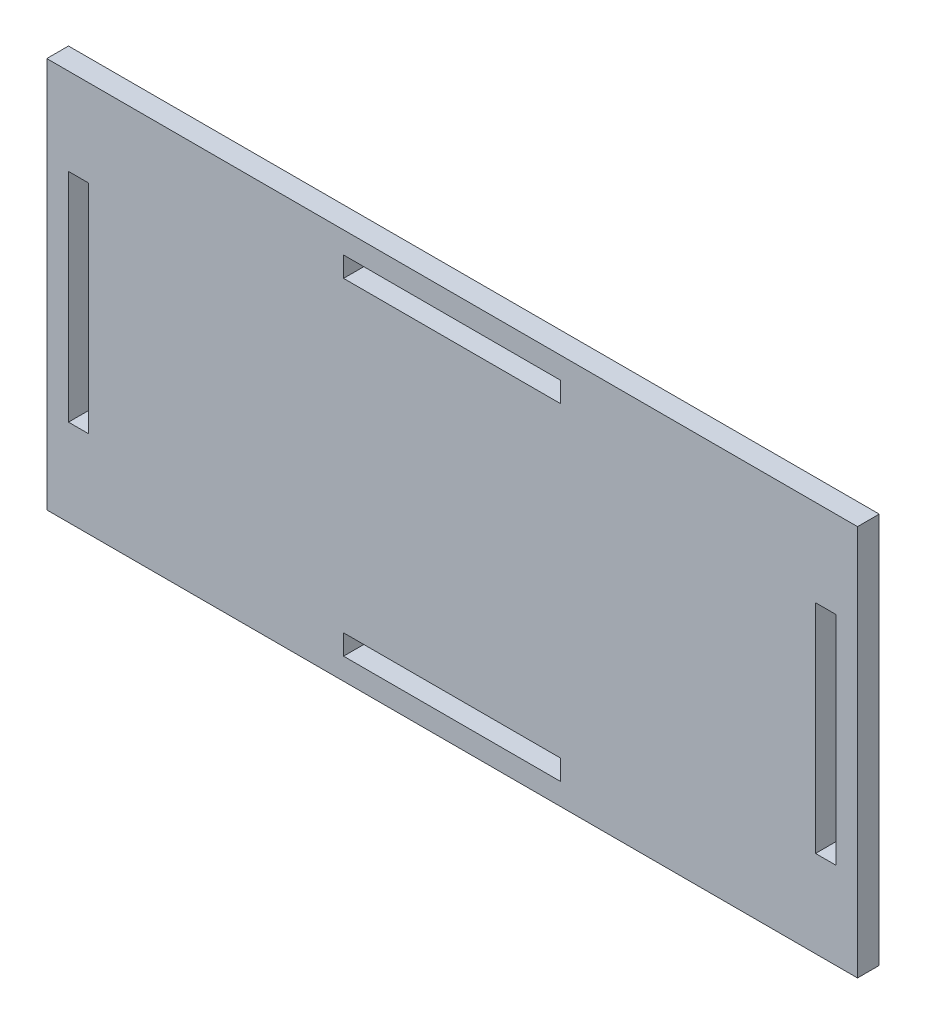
ISO-10303-21;
HEADER;
FILE_DESCRIPTION(('STEP AP214'),'2;1');
FILE_NAME('part.step','',(''),(''),'','','');
FILE_SCHEMA(('AUTOMOTIVE_DESIGN { 1 0 10303 214 1 1 1 1 }'));
ENDSEC;
DATA;
#1=APPLICATION_CONTEXT('core data for automotive mechanical design processes');
#2=APPLICATION_PROTOCOL_DEFINITION('international standard','automotive_design',2000,#1);
#3=PRODUCT_CONTEXT('',#1,'mechanical');
#4=PRODUCT('Part','Part','',(#3));
#5=PRODUCT_RELATED_PRODUCT_CATEGORY('part','',(#4));
#6=PRODUCT_DEFINITION_FORMATION('','',#4);
#7=PRODUCT_DEFINITION_CONTEXT('part definition',#1,'design');
#8=PRODUCT_DEFINITION('design','',#6,#7);
#9=PRODUCT_DEFINITION_SHAPE('','',#8);
#10=(LENGTH_UNIT() NAMED_UNIT(*) SI_UNIT(.MILLI.,.METRE.));
#11=(NAMED_UNIT(*) PLANE_ANGLE_UNIT() SI_UNIT($,.RADIAN.));
#12=(NAMED_UNIT(*) SI_UNIT($,.STERADIAN.) SOLID_ANGLE_UNIT());
#13=UNCERTAINTY_MEASURE_WITH_UNIT(LENGTH_MEASURE(1.E-05),#10,'distance_accuracy_value','');
#14=(GEOMETRIC_REPRESENTATION_CONTEXT(3) GLOBAL_UNCERTAINTY_ASSIGNED_CONTEXT((#13)) GLOBAL_UNIT_ASSIGNED_CONTEXT((#10,
#11,#12)) REPRESENTATION_CONTEXT('',''));
#15=CARTESIAN_POINT('',(0.,0.,0.));
#16=DIRECTION('',(0.,0.,1.));
#17=DIRECTION('',(1.,0.,0.));
#18=AXIS2_PLACEMENT_3D('',#15,#16,#17);
#19=CARTESIAN_POINT('',(0.,0.,3.));
#20=DIRECTION('',(0.,0.,-1.));
#21=DIRECTION('',(-1.,0.,0.));
#22=AXIS2_PLACEMENT_3D('',#19,#20,#21);
#23=PLANE('',#22);
#24=DIRECTION('',(0.,-1.,0.));
#25=VECTOR('',#24,1.);
#26=CARTESIAN_POINT('',(-15.,-21.2,3.));
#27=LINE('',#26,#25);
#28=CARTESIAN_POINT('',(-15.,-21.2,3.));
#29=VERTEX_POINT('',#28);
#30=CARTESIAN_POINT('',(-15.,-24.,3.));
#31=VERTEX_POINT('',#30);
#32=EDGE_CURVE('E206',#29,#31,#27,.T.);
#33=ORIENTED_EDGE('',*,*,#32,.F.);
#34=DIRECTION('',(-1.,0.,0.));
#35=VECTOR('',#34,1.);
#36=CARTESIAN_POINT('',(-15.,-21.2,3.));
#37=LINE('',#36,#35);
#38=CARTESIAN_POINT('',(15.,-21.2,3.));
#39=VERTEX_POINT('',#38);
#40=EDGE_CURVE('E214',#39,#29,#37,.T.);
#41=ORIENTED_EDGE('',*,*,#40,.F.);
#42=DIRECTION('',(0.,1.,0.));
#43=VECTOR('',#42,1.);
#44=CARTESIAN_POINT('',(15.,-21.2,3.));
#45=LINE('',#44,#43);
#46=CARTESIAN_POINT('',(15.,-24.,3.));
#47=VERTEX_POINT('',#46);
#48=EDGE_CURVE('E211',#47,#39,#45,.T.);
#49=ORIENTED_EDGE('',*,*,#48,.F.);
#50=DIRECTION('',(1.,0.,0.));
#51=VECTOR('',#50,1.);
#52=CARTESIAN_POINT('',(-15.,-24.,3.));
#53=LINE('',#52,#51);
#54=EDGE_CURVE('E208',#31,#47,#53,.T.);
#55=ORIENTED_EDGE('',*,*,#54,.F.);
#56=EDGE_LOOP('',(#33,#41,#49,#55));
#57=FACE_BOUND('',#56,.T.);
#58=DIRECTION('',(0.,1.,0.));
#59=VECTOR('',#58,1.);
#60=CARTESIAN_POINT('',(15.,21.2,3.));
#61=LINE('',#60,#59);
#62=CARTESIAN_POINT('',(15.,21.2,3.));
#63=VERTEX_POINT('',#62);
#64=CARTESIAN_POINT('',(15.,24.,3.));
#65=VERTEX_POINT('',#64);
#66=EDGE_CURVE('E268',#63,#65,#61,.T.);
#67=ORIENTED_EDGE('',*,*,#66,.F.);
#68=DIRECTION('',(1.,0.,0.));
#69=VECTOR('',#68,1.);
#70=CARTESIAN_POINT('',(-15.,21.2,3.));
#71=LINE('',#70,#69);
#72=CARTESIAN_POINT('',(-15.,21.2,3.));
#73=VERTEX_POINT('',#72);
#74=EDGE_CURVE('E276',#73,#63,#71,.T.);
#75=ORIENTED_EDGE('',*,*,#74,.F.);
#76=DIRECTION('',(0.,-1.,0.));
#77=VECTOR('',#76,1.);
#78=CARTESIAN_POINT('',(-15.,21.2,3.));
#79=LINE('',#78,#77);
#80=CARTESIAN_POINT('',(-15.,24.,3.));
#81=VERTEX_POINT('',#80);
#82=EDGE_CURVE('E273',#81,#73,#79,.T.);
#83=ORIENTED_EDGE('',*,*,#82,.F.);
#84=DIRECTION('',(-1.,0.,0.));
#85=VECTOR('',#84,1.);
#86=CARTESIAN_POINT('',(-15.,24.,3.));
#87=LINE('',#86,#85);
#88=EDGE_CURVE('E270',#65,#81,#87,.T.);
#89=ORIENTED_EDGE('',*,*,#88,.F.);
#90=EDGE_LOOP('',(#67,#75,#83,#89));
#91=FACE_BOUND('',#90,.T.);
#92=DIRECTION('',(0.,1.,0.));
#93=VECTOR('',#92,1.);
#94=CARTESIAN_POINT('',(56.,-27.,3.));
#95=LINE('',#94,#93);
#96=CARTESIAN_POINT('',(56.,-27.,3.));
#97=VERTEX_POINT('',#96);
#98=CARTESIAN_POINT('',(56.,27.,3.));
#99=VERTEX_POINT('',#98);
#100=EDGE_CURVE('E299',#97,#99,#95,.T.);
#101=ORIENTED_EDGE('',*,*,#100,.T.);
#102=DIRECTION('',(-1.,0.,0.));
#103=VECTOR('',#102,1.);
#104=CARTESIAN_POINT('',(-56.,27.,3.));
#105=LINE('',#104,#103);
#106=CARTESIAN_POINT('',(-56.,27.,3.));
#107=VERTEX_POINT('',#106);
#108=EDGE_CURVE('E302',#99,#107,#105,.T.);
#109=ORIENTED_EDGE('',*,*,#108,.T.);
#110=DIRECTION('',(0.,-1.,0.));
#111=VECTOR('',#110,1.);
#112=CARTESIAN_POINT('',(-56.,-27.,3.));
#113=LINE('',#112,#111);
#114=CARTESIAN_POINT('',(-56.,-27.,3.));
#115=VERTEX_POINT('',#114);
#116=EDGE_CURVE('E305',#107,#115,#113,.T.);
#117=ORIENTED_EDGE('',*,*,#116,.T.);
#118=DIRECTION('',(1.,0.,0.));
#119=VECTOR('',#118,1.);
#120=CARTESIAN_POINT('',(-56.,-27.,3.));
#121=LINE('',#120,#119);
#122=EDGE_CURVE('E307',#115,#97,#121,.T.);
#123=ORIENTED_EDGE('',*,*,#122,.T.);
#124=EDGE_LOOP('',(#101,#109,#117,#123));
#125=FACE_BOUND('',#124,.T.);
#126=DIRECTION('',(0.,1.,0.));
#127=VECTOR('',#126,1.);
#128=CARTESIAN_POINT('',(-50.2,-15.,3.));
#129=LINE('',#128,#127);
#130=CARTESIAN_POINT('',(-50.2,-15.,3.));
#131=VERTEX_POINT('',#130);
#132=CARTESIAN_POINT('',(-50.2,15.,3.));
#133=VERTEX_POINT('',#132);
#134=EDGE_CURVE('E237',#131,#133,#129,.T.);
#135=ORIENTED_EDGE('',*,*,#134,.F.);
#136=DIRECTION('',(1.,0.,0.));
#137=VECTOR('',#136,1.);
#138=CARTESIAN_POINT('',(-53.,-15.,3.));
#139=LINE('',#138,#137);
#140=CARTESIAN_POINT('',(-53.,-15.,3.));
#141=VERTEX_POINT('',#140);
#142=EDGE_CURVE('E245',#141,#131,#139,.T.);
#143=ORIENTED_EDGE('',*,*,#142,.F.);
#144=DIRECTION('',(0.,-1.,0.));
#145=VECTOR('',#144,1.);
#146=CARTESIAN_POINT('',(-53.,-15.,3.));
#147=LINE('',#146,#145);
#148=CARTESIAN_POINT('',(-53.,15.,3.));
#149=VERTEX_POINT('',#148);
#150=EDGE_CURVE('E242',#149,#141,#147,.T.);
#151=ORIENTED_EDGE('',*,*,#150,.F.);
#152=DIRECTION('',(-1.,0.,0.));
#153=VECTOR('',#152,1.);
#154=CARTESIAN_POINT('',(-53.,15.,3.));
#155=LINE('',#154,#153);
#156=EDGE_CURVE('E239',#133,#149,#155,.T.);
#157=ORIENTED_EDGE('',*,*,#156,.F.);
#158=EDGE_LOOP('',(#135,#143,#151,#157));
#159=FACE_BOUND('',#158,.T.);
#160=DIRECTION('',(0.,1.,0.));
#161=VECTOR('',#160,1.);
#162=CARTESIAN_POINT('',(53.0000000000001,-14.9999999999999,3.));
#163=LINE('',#162,#161);
#164=CARTESIAN_POINT('',(53.0000000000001,-14.9999999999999,3.));
#165=VERTEX_POINT('',#164);
#166=CARTESIAN_POINT('',(53.,15.0000000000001,3.));
#167=VERTEX_POINT('',#166);
#168=EDGE_CURVE('E170',#165,#167,#163,.T.);
#169=ORIENTED_EDGE('',*,*,#168,.F.);
#170=DIRECTION('',(1.,0.,0.));
#171=VECTOR('',#170,1.);
#172=CARTESIAN_POINT('',(53.0000000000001,-14.9999999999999,3.));
#173=LINE('',#172,#171);
#174=CARTESIAN_POINT('',(50.2000000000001,-14.9999999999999,3.));
#175=VERTEX_POINT('',#174);
#176=EDGE_CURVE('E192',#175,#165,#173,.T.);
#177=ORIENTED_EDGE('',*,*,#176,.F.);
#178=DIRECTION('',(0.,-1.,0.));
#179=VECTOR('',#178,1.);
#180=CARTESIAN_POINT('',(50.2000000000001,-14.9999999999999,3.));
#181=LINE('',#180,#179);
#182=CARTESIAN_POINT('',(50.2,15.0000000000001,3.));
#183=VERTEX_POINT('',#182);
#184=EDGE_CURVE('E190',#183,#175,#181,.T.);
#185=ORIENTED_EDGE('',*,*,#184,.F.);
#186=DIRECTION('',(-1.,0.,0.));
#187=VECTOR('',#186,1.);
#188=CARTESIAN_POINT('',(53.,15.0000000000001,3.));
#189=LINE('',#188,#187);
#190=EDGE_CURVE('E178',#167,#183,#189,.T.);
#191=ORIENTED_EDGE('',*,*,#190,.F.);
#192=EDGE_LOOP('',(#169,#177,#185,#191));
#193=FACE_BOUND('',#192,.T.);
#194=ADVANCED_FACE('F33',(#57,#91,#125,#159,#193),#23,.F.);
#195=CARTESIAN_POINT('',(0.,0.,0.));
#196=DIRECTION('',(0.,0.,-1.));
#197=DIRECTION('',(-1.,0.,0.));
#198=AXIS2_PLACEMENT_3D('',#195,#196,#197);
#199=PLANE('',#198);
#200=DIRECTION('',(0.,1.,0.));
#201=VECTOR('',#200,1.);
#202=CARTESIAN_POINT('',(56.,-27.,0.));
#203=LINE('',#202,#201);
#204=CARTESIAN_POINT('',(56.,-27.,0.));
#205=VERTEX_POINT('',#204);
#206=CARTESIAN_POINT('',(56.,27.,0.));
#207=VERTEX_POINT('',#206);
#208=EDGE_CURVE('E298',#205,#207,#203,.T.);
#209=ORIENTED_EDGE('',*,*,#208,.F.);
#210=DIRECTION('',(1.,0.,0.));
#211=VECTOR('',#210,1.);
#212=CARTESIAN_POINT('',(-56.,-27.,0.));
#213=LINE('',#212,#211);
#214=CARTESIAN_POINT('',(-56.,-27.,0.));
#215=VERTEX_POINT('',#214);
#216=EDGE_CURVE('E303',#215,#205,#213,.T.);
#217=ORIENTED_EDGE('',*,*,#216,.F.);
#218=DIRECTION('',(0.,-1.,0.));
#219=VECTOR('',#218,1.);
#220=CARTESIAN_POINT('',(-56.,-27.,0.));
#221=LINE('',#220,#219);
#222=CARTESIAN_POINT('',(-56.,27.,0.));
#223=VERTEX_POINT('',#222);
#224=EDGE_CURVE('E314',#223,#215,#221,.T.);
#225=ORIENTED_EDGE('',*,*,#224,.F.);
#226=DIRECTION('',(-1.,0.,0.));
#227=VECTOR('',#226,1.);
#228=CARTESIAN_POINT('',(-56.,27.,0.));
#229=LINE('',#228,#227);
#230=EDGE_CURVE('E312',#207,#223,#229,.T.);
#231=ORIENTED_EDGE('',*,*,#230,.F.);
#232=EDGE_LOOP('',(#209,#217,#225,#231));
#233=FACE_BOUND('',#232,.T.);
#234=DIRECTION('',(1.,0.,0.));
#235=VECTOR('',#234,1.);
#236=CARTESIAN_POINT('',(-15.,21.2,0.));
#237=LINE('',#236,#235);
#238=CARTESIAN_POINT('',(-15.,21.2,0.));
#239=VERTEX_POINT('',#238);
#240=CARTESIAN_POINT('',(15.,21.2,0.));
#241=VERTEX_POINT('',#240);
#242=EDGE_CURVE('E271',#239,#241,#237,.T.);
#243=ORIENTED_EDGE('',*,*,#242,.T.);
#244=DIRECTION('',(0.,1.,0.));
#245=VECTOR('',#244,1.);
#246=CARTESIAN_POINT('',(15.,21.2,0.));
#247=LINE('',#246,#245);
#248=CARTESIAN_POINT('',(15.,24.,0.));
#249=VERTEX_POINT('',#248);
#250=EDGE_CURVE('E267',#241,#249,#247,.T.);
#251=ORIENTED_EDGE('',*,*,#250,.T.);
#252=DIRECTION('',(-1.,0.,0.));
#253=VECTOR('',#252,1.);
#254=CARTESIAN_POINT('',(-15.,24.,0.));
#255=LINE('',#254,#253);
#256=CARTESIAN_POINT('',(-15.,24.,0.));
#257=VERTEX_POINT('',#256);
#258=EDGE_CURVE('E281',#249,#257,#255,.T.);
#259=ORIENTED_EDGE('',*,*,#258,.T.);
#260=DIRECTION('',(0.,-1.,0.));
#261=VECTOR('',#260,1.);
#262=CARTESIAN_POINT('',(-15.,21.2,0.));
#263=LINE('',#262,#261);
#264=EDGE_CURVE('E284',#257,#239,#263,.T.);
#265=ORIENTED_EDGE('',*,*,#264,.T.);
#266=EDGE_LOOP('',(#243,#251,#259,#265));
#267=FACE_BOUND('',#266,.T.);
#268=DIRECTION('',(1.,0.,0.));
#269=VECTOR('',#268,1.);
#270=CARTESIAN_POINT('',(-53.,-15.,0.));
#271=LINE('',#270,#269);
#272=CARTESIAN_POINT('',(-53.,-15.,0.));
#273=VERTEX_POINT('',#272);
#274=CARTESIAN_POINT('',(-50.2,-15.,0.));
#275=VERTEX_POINT('',#274);
#276=EDGE_CURVE('E240',#273,#275,#271,.T.);
#277=ORIENTED_EDGE('',*,*,#276,.T.);
#278=DIRECTION('',(0.,1.,0.));
#279=VECTOR('',#278,1.);
#280=CARTESIAN_POINT('',(-50.2,-15.,0.));
#281=LINE('',#280,#279);
#282=CARTESIAN_POINT('',(-50.2,15.,0.));
#283=VERTEX_POINT('',#282);
#284=EDGE_CURVE('E236',#275,#283,#281,.T.);
#285=ORIENTED_EDGE('',*,*,#284,.T.);
#286=DIRECTION('',(-1.,0.,0.));
#287=VECTOR('',#286,1.);
#288=CARTESIAN_POINT('',(-53.,15.,0.));
#289=LINE('',#288,#287);
#290=CARTESIAN_POINT('',(-53.,15.,0.));
#291=VERTEX_POINT('',#290);
#292=EDGE_CURVE('E250',#283,#291,#289,.T.);
#293=ORIENTED_EDGE('',*,*,#292,.T.);
#294=DIRECTION('',(0.,-1.,0.));
#295=VECTOR('',#294,1.);
#296=CARTESIAN_POINT('',(-53.,-15.,0.));
#297=LINE('',#296,#295);
#298=EDGE_CURVE('E253',#291,#273,#297,.T.);
#299=ORIENTED_EDGE('',*,*,#298,.T.);
#300=EDGE_LOOP('',(#277,#285,#293,#299));
#301=FACE_BOUND('',#300,.T.);
#302=DIRECTION('',(-1.,0.,0.));
#303=VECTOR('',#302,1.);
#304=CARTESIAN_POINT('',(-15.,-21.2,0.));
#305=LINE('',#304,#303);
#306=CARTESIAN_POINT('',(15.,-21.2,0.));
#307=VERTEX_POINT('',#306);
#308=CARTESIAN_POINT('',(-15.,-21.2,0.));
#309=VERTEX_POINT('',#308);
#310=EDGE_CURVE('E209',#307,#309,#305,.T.);
#311=ORIENTED_EDGE('',*,*,#310,.T.);
#312=DIRECTION('',(0.,-1.,0.));
#313=VECTOR('',#312,1.);
#314=CARTESIAN_POINT('',(-15.,-21.2,0.));
#315=LINE('',#314,#313);
#316=CARTESIAN_POINT('',(-15.,-24.,0.));
#317=VERTEX_POINT('',#316);
#318=EDGE_CURVE('E186',#309,#317,#315,.T.);
#319=ORIENTED_EDGE('',*,*,#318,.T.);
#320=DIRECTION('',(1.,0.,0.));
#321=VECTOR('',#320,1.);
#322=CARTESIAN_POINT('',(-15.,-24.,0.));
#323=LINE('',#322,#321);
#324=CARTESIAN_POINT('',(15.,-24.,0.));
#325=VERTEX_POINT('',#324);
#326=EDGE_CURVE('E219',#317,#325,#323,.T.);
#327=ORIENTED_EDGE('',*,*,#326,.T.);
#328=DIRECTION('',(0.,1.,0.));
#329=VECTOR('',#328,1.);
#330=CARTESIAN_POINT('',(15.,-21.2,0.));
#331=LINE('',#330,#329);
#332=EDGE_CURVE('E222',#325,#307,#331,.T.);
#333=ORIENTED_EDGE('',*,*,#332,.T.);
#334=EDGE_LOOP('',(#311,#319,#327,#333));
#335=FACE_BOUND('',#334,.T.);
#336=DIRECTION('',(1.,0.,0.));
#337=VECTOR('',#336,1.);
#338=CARTESIAN_POINT('',(53.0000000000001,-14.9999999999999,0.));
#339=LINE('',#338,#337);
#340=CARTESIAN_POINT('',(50.2000000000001,-14.9999999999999,0.));
#341=VERTEX_POINT('',#340);
#342=CARTESIAN_POINT('',(53.0000000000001,-14.9999999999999,0.));
#343=VERTEX_POINT('',#342);
#344=EDGE_CURVE('E179',#341,#343,#339,.T.);
#345=ORIENTED_EDGE('',*,*,#344,.T.);
#346=DIRECTION('',(0.,1.,0.));
#347=VECTOR('',#346,1.);
#348=CARTESIAN_POINT('',(53.0000000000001,-14.9999999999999,0.));
#349=LINE('',#348,#347);
#350=CARTESIAN_POINT('',(53.,15.0000000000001,0.));
#351=VERTEX_POINT('',#350);
#352=EDGE_CURVE('E56',#343,#351,#349,.T.);
#353=ORIENTED_EDGE('',*,*,#352,.T.);
#354=DIRECTION('',(-1.,0.,0.));
#355=VECTOR('',#354,1.);
#356=CARTESIAN_POINT('',(53.,15.0000000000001,0.));
#357=LINE('',#356,#355);
#358=CARTESIAN_POINT('',(50.2,15.0000000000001,0.));
#359=VERTEX_POINT('',#358);
#360=EDGE_CURVE('E185',#351,#359,#357,.T.);
#361=ORIENTED_EDGE('',*,*,#360,.T.);
#362=DIRECTION('',(0.,-1.,0.));
#363=VECTOR('',#362,1.);
#364=CARTESIAN_POINT('',(50.2000000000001,-14.9999999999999,0.));
#365=LINE('',#364,#363);
#366=EDGE_CURVE('E198',#359,#341,#365,.T.);
#367=ORIENTED_EDGE('',*,*,#366,.T.);
#368=EDGE_LOOP('',(#345,#353,#361,#367));
#369=FACE_BOUND('',#368,.T.);
#370=ADVANCED_FACE('F332',(#233,#267,#301,#335,#369),#199,.T.);
#371=CARTESIAN_POINT('',(56.,-27.,3.));
#372=DIRECTION('',(-1.,0.,0.));
#373=DIRECTION('',(0.,0.,1.));
#374=AXIS2_PLACEMENT_3D('',#371,#372,#373);
#375=PLANE('',#374);
#376=ORIENTED_EDGE('',*,*,#208,.T.);
#377=DIRECTION('',(0.,0.,-1.));
#378=VECTOR('',#377,1.);
#379=CARTESIAN_POINT('',(56.,27.,3.));
#380=LINE('',#379,#378);
#381=EDGE_CURVE('E11',#99,#207,#380,.T.);
#382=ORIENTED_EDGE('',*,*,#381,.F.);
#383=ORIENTED_EDGE('',*,*,#100,.F.);
#384=DIRECTION('',(0.,0.,-1.));
#385=VECTOR('',#384,1.);
#386=CARTESIAN_POINT('',(56.,-27.,3.));
#387=LINE('',#386,#385);
#388=EDGE_CURVE('E309',#97,#205,#387,.T.);
#389=ORIENTED_EDGE('',*,*,#388,.T.);
#390=EDGE_LOOP('',(#376,#382,#383,#389));
#391=FACE_BOUND('',#390,.T.);
#392=ADVANCED_FACE('F35',(#391),#375,.F.);
#393=CARTESIAN_POINT('',(-56.,27.,3.));
#394=DIRECTION('',(0.,-1.,0.));
#395=DIRECTION('',(0.,0.,-1.));
#396=AXIS2_PLACEMENT_3D('',#393,#394,#395);
#397=PLANE('',#396);
#398=ORIENTED_EDGE('',*,*,#230,.T.);
#399=DIRECTION('',(0.,0.,-1.));
#400=VECTOR('',#399,1.);
#401=CARTESIAN_POINT('',(-56.,27.,3.));
#402=LINE('',#401,#400);
#403=EDGE_CURVE('E41',#107,#223,#402,.T.);
#404=ORIENTED_EDGE('',*,*,#403,.F.);
#405=ORIENTED_EDGE('',*,*,#108,.F.);
#406=ORIENTED_EDGE('',*,*,#381,.T.);
#407=EDGE_LOOP('',(#398,#404,#405,#406));
#408=FACE_BOUND('',#407,.T.);
#409=ADVANCED_FACE('F343',(#408),#397,.F.);
#410=CARTESIAN_POINT('',(-56.,-27.,3.));
#411=DIRECTION('',(1.,0.,0.));
#412=DIRECTION('',(0.,0.,-1.));
#413=AXIS2_PLACEMENT_3D('',#410,#411,#412);
#414=PLANE('',#413);
#415=ORIENTED_EDGE('',*,*,#224,.T.);
#416=DIRECTION('',(0.,0.,-1.));
#417=VECTOR('',#416,1.);
#418=CARTESIAN_POINT('',(-56.,-27.,3.));
#419=LINE('',#418,#417);
#420=EDGE_CURVE('E319',#115,#215,#419,.T.);
#421=ORIENTED_EDGE('',*,*,#420,.F.);
#422=ORIENTED_EDGE('',*,*,#116,.F.);
#423=ORIENTED_EDGE('',*,*,#403,.T.);
#424=EDGE_LOOP('',(#415,#421,#422,#423));
#425=FACE_BOUND('',#424,.T.);
#426=ADVANCED_FACE('F326',(#425),#414,.F.);
#427=CARTESIAN_POINT('',(-56.,-27.,3.));
#428=DIRECTION('',(0.,1.,0.));
#429=DIRECTION('',(0.,0.,1.));
#430=AXIS2_PLACEMENT_3D('',#427,#428,#429);
#431=PLANE('',#430);
#432=ORIENTED_EDGE('',*,*,#216,.T.);
#433=ORIENTED_EDGE('',*,*,#388,.F.);
#434=ORIENTED_EDGE('',*,*,#122,.F.);
#435=ORIENTED_EDGE('',*,*,#420,.T.);
#436=EDGE_LOOP('',(#432,#433,#434,#435));
#437=FACE_BOUND('',#436,.T.);
#438=ADVANCED_FACE('F336',(#437),#431,.F.);
#439=CARTESIAN_POINT('',(15.,21.2,3.));
#440=DIRECTION('',(-1.,0.,0.));
#441=DIRECTION('',(0.,0.,1.));
#442=AXIS2_PLACEMENT_3D('',#439,#440,#441);
#443=PLANE('',#442);
#444=ORIENTED_EDGE('',*,*,#250,.F.);
#445=DIRECTION('',(0.,0.,-1.));
#446=VECTOR('',#445,1.);
#447=CARTESIAN_POINT('',(15.,21.2,3.));
#448=LINE('',#447,#446);
#449=EDGE_CURVE('E278',#63,#241,#448,.T.);
#450=ORIENTED_EDGE('',*,*,#449,.F.);
#451=ORIENTED_EDGE('',*,*,#66,.T.);
#452=DIRECTION('',(0.,0.,-1.));
#453=VECTOR('',#452,1.);
#454=CARTESIAN_POINT('',(15.,24.,3.));
#455=LINE('',#454,#453);
#456=EDGE_CURVE('E295',#65,#249,#455,.T.);
#457=ORIENTED_EDGE('',*,*,#456,.T.);
#458=EDGE_LOOP('',(#444,#450,#451,#457));
#459=FACE_BOUND('',#458,.T.);
#460=ADVANCED_FACE('F360',(#459),#443,.T.);
#461=CARTESIAN_POINT('',(-15.,24.,3.));
#462=DIRECTION('',(0.,-1.,0.));
#463=DIRECTION('',(0.,0.,-1.));
#464=AXIS2_PLACEMENT_3D('',#461,#462,#463);
#465=PLANE('',#464);
#466=ORIENTED_EDGE('',*,*,#258,.F.);
#467=ORIENTED_EDGE('',*,*,#456,.F.);
#468=ORIENTED_EDGE('',*,*,#88,.T.);
#469=DIRECTION('',(0.,0.,-1.));
#470=VECTOR('',#469,1.);
#471=CARTESIAN_POINT('',(-15.,24.,3.));
#472=LINE('',#471,#470);
#473=EDGE_CURVE('E293',#81,#257,#472,.T.);
#474=ORIENTED_EDGE('',*,*,#473,.T.);
#475=EDGE_LOOP('',(#466,#467,#468,#474));
#476=FACE_BOUND('',#475,.T.);
#477=ADVANCED_FACE('F367',(#476),#465,.T.);
#478=CARTESIAN_POINT('',(-15.,21.2,3.));
#479=DIRECTION('',(1.,0.,0.));
#480=DIRECTION('',(0.,0.,-1.));
#481=AXIS2_PLACEMENT_3D('',#478,#479,#480);
#482=PLANE('',#481);
#483=ORIENTED_EDGE('',*,*,#264,.F.);
#484=ORIENTED_EDGE('',*,*,#473,.F.);
#485=ORIENTED_EDGE('',*,*,#82,.T.);
#486=DIRECTION('',(0.,0.,-1.));
#487=VECTOR('',#486,1.);
#488=CARTESIAN_POINT('',(-15.,21.2,3.));
#489=LINE('',#488,#487);
#490=EDGE_CURVE('E291',#73,#239,#489,.T.);
#491=ORIENTED_EDGE('',*,*,#490,.T.);
#492=EDGE_LOOP('',(#483,#484,#485,#491));
#493=FACE_BOUND('',#492,.T.);
#494=ADVANCED_FACE('F372',(#493),#482,.T.);
#495=CARTESIAN_POINT('',(-15.,21.2,3.));
#496=DIRECTION('',(0.,1.,0.));
#497=DIRECTION('',(0.,0.,1.));
#498=AXIS2_PLACEMENT_3D('',#495,#496,#497);
#499=PLANE('',#498);
#500=ORIENTED_EDGE('',*,*,#242,.F.);
#501=ORIENTED_EDGE('',*,*,#490,.F.);
#502=ORIENTED_EDGE('',*,*,#74,.T.);
#503=ORIENTED_EDGE('',*,*,#449,.T.);
#504=EDGE_LOOP('',(#500,#501,#502,#503));
#505=FACE_BOUND('',#504,.T.);
#506=ADVANCED_FACE('F379',(#505),#499,.T.);
#507=CARTESIAN_POINT('',(-50.2,-15.,3.));
#508=DIRECTION('',(-1.,0.,0.));
#509=DIRECTION('',(0.,0.,1.));
#510=AXIS2_PLACEMENT_3D('',#507,#508,#509);
#511=PLANE('',#510);
#512=ORIENTED_EDGE('',*,*,#284,.F.);
#513=DIRECTION('',(0.,0.,-1.));
#514=VECTOR('',#513,1.);
#515=CARTESIAN_POINT('',(-50.2,-15.,3.));
#516=LINE('',#515,#514);
#517=EDGE_CURVE('E247',#131,#275,#516,.T.);
#518=ORIENTED_EDGE('',*,*,#517,.F.);
#519=ORIENTED_EDGE('',*,*,#134,.T.);
#520=DIRECTION('',(0.,0.,-1.));
#521=VECTOR('',#520,1.);
#522=CARTESIAN_POINT('',(-50.2,15.,3.));
#523=LINE('',#522,#521);
#524=EDGE_CURVE('E264',#133,#283,#523,.T.);
#525=ORIENTED_EDGE('',*,*,#524,.T.);
#526=EDGE_LOOP('',(#512,#518,#519,#525));
#527=FACE_BOUND('',#526,.T.);
#528=ADVANCED_FACE('F392',(#527),#511,.T.);
#529=CARTESIAN_POINT('',(-53.,15.,3.));
#530=DIRECTION('',(0.,-1.,0.));
#531=DIRECTION('',(0.,0.,-1.));
#532=AXIS2_PLACEMENT_3D('',#529,#530,#531);
#533=PLANE('',#532);
#534=ORIENTED_EDGE('',*,*,#292,.F.);
#535=ORIENTED_EDGE('',*,*,#524,.F.);
#536=ORIENTED_EDGE('',*,*,#156,.T.);
#537=DIRECTION('',(0.,0.,-1.));
#538=VECTOR('',#537,1.);
#539=CARTESIAN_POINT('',(-53.,15.,3.));
#540=LINE('',#539,#538);
#541=EDGE_CURVE('E262',#149,#291,#540,.T.);
#542=ORIENTED_EDGE('',*,*,#541,.T.);
#543=EDGE_LOOP('',(#534,#535,#536,#542));
#544=FACE_BOUND('',#543,.T.);
#545=ADVANCED_FACE('F397',(#544),#533,.T.);
#546=CARTESIAN_POINT('',(-53.,-15.,3.));
#547=DIRECTION('',(1.,0.,0.));
#548=DIRECTION('',(0.,0.,-1.));
#549=AXIS2_PLACEMENT_3D('',#546,#547,#548);
#550=PLANE('',#549);
#551=ORIENTED_EDGE('',*,*,#298,.F.);
#552=ORIENTED_EDGE('',*,*,#541,.F.);
#553=ORIENTED_EDGE('',*,*,#150,.T.);
#554=DIRECTION('',(0.,0.,-1.));
#555=VECTOR('',#554,1.);
#556=CARTESIAN_POINT('',(-53.,-15.,3.));
#557=LINE('',#556,#555);
#558=EDGE_CURVE('E260',#141,#273,#557,.T.);
#559=ORIENTED_EDGE('',*,*,#558,.T.);
#560=EDGE_LOOP('',(#551,#552,#553,#559));
#561=FACE_BOUND('',#560,.T.);
#562=ADVANCED_FACE('F401',(#561),#550,.T.);
#563=CARTESIAN_POINT('',(-53.,-15.,3.));
#564=DIRECTION('',(0.,1.,0.));
#565=DIRECTION('',(0.,0.,1.));
#566=AXIS2_PLACEMENT_3D('',#563,#564,#565);
#567=PLANE('',#566);
#568=ORIENTED_EDGE('',*,*,#276,.F.);
#569=ORIENTED_EDGE('',*,*,#558,.F.);
#570=ORIENTED_EDGE('',*,*,#142,.T.);
#571=ORIENTED_EDGE('',*,*,#517,.T.);
#572=EDGE_LOOP('',(#568,#569,#570,#571));
#573=FACE_BOUND('',#572,.T.);
#574=ADVANCED_FACE('F405',(#573),#567,.T.);
#575=CARTESIAN_POINT('',(-15.,-21.2,3.));
#576=DIRECTION('',(1.,0.,0.));
#577=DIRECTION('',(0.,1.,0.));
#578=AXIS2_PLACEMENT_3D('',#575,#576,#577);
#579=PLANE('',#578);
#580=ORIENTED_EDGE('',*,*,#318,.F.);
#581=DIRECTION('',(0.,0.,-1.));
#582=VECTOR('',#581,1.);
#583=CARTESIAN_POINT('',(-15.,-21.2,3.));
#584=LINE('',#583,#582);
#585=EDGE_CURVE('E216',#29,#309,#584,.T.);
#586=ORIENTED_EDGE('',*,*,#585,.F.);
#587=ORIENTED_EDGE('',*,*,#32,.T.);
#588=DIRECTION('',(0.,0.,-1.));
#589=VECTOR('',#588,1.);
#590=CARTESIAN_POINT('',(-15.,-24.,3.));
#591=LINE('',#590,#589);
#592=EDGE_CURVE('E233',#31,#317,#591,.T.);
#593=ORIENTED_EDGE('',*,*,#592,.T.);
#594=EDGE_LOOP('',(#580,#586,#587,#593));
#595=FACE_BOUND('',#594,.T.);
#596=ADVANCED_FACE('F409',(#595),#579,.T.);
#597=CARTESIAN_POINT('',(-15.,-24.,3.));
#598=DIRECTION('',(0.,1.,0.));
#599=DIRECTION('',(-1.,0.,0.));
#600=AXIS2_PLACEMENT_3D('',#597,#598,#599);
#601=PLANE('',#600);
#602=ORIENTED_EDGE('',*,*,#326,.F.);
#603=ORIENTED_EDGE('',*,*,#592,.F.);
#604=ORIENTED_EDGE('',*,*,#54,.T.);
#605=DIRECTION('',(0.,0.,-1.));
#606=VECTOR('',#605,1.);
#607=CARTESIAN_POINT('',(15.,-24.,3.));
#608=LINE('',#607,#606);
#609=EDGE_CURVE('E231',#47,#325,#608,.T.);
#610=ORIENTED_EDGE('',*,*,#609,.T.);
#611=EDGE_LOOP('',(#602,#603,#604,#610));
#612=FACE_BOUND('',#611,.T.);
#613=ADVANCED_FACE('F413',(#612),#601,.T.);
#614=CARTESIAN_POINT('',(15.,-21.2,3.));
#615=DIRECTION('',(-1.,0.,0.));
#616=DIRECTION('',(0.,-1.,0.));
#617=AXIS2_PLACEMENT_3D('',#614,#615,#616);
#618=PLANE('',#617);
#619=ORIENTED_EDGE('',*,*,#332,.F.);
#620=ORIENTED_EDGE('',*,*,#609,.F.);
#621=ORIENTED_EDGE('',*,*,#48,.T.);
#622=DIRECTION('',(0.,0.,-1.));
#623=VECTOR('',#622,1.);
#624=CARTESIAN_POINT('',(15.,-21.2,3.));
#625=LINE('',#624,#623);
#626=EDGE_CURVE('E229',#39,#307,#625,.T.);
#627=ORIENTED_EDGE('',*,*,#626,.T.);
#628=EDGE_LOOP('',(#619,#620,#621,#627));
#629=FACE_BOUND('',#628,.T.);
#630=ADVANCED_FACE('F417',(#629),#618,.T.);
#631=CARTESIAN_POINT('',(-15.,-21.2,3.));
#632=DIRECTION('',(0.,-1.,0.));
#633=DIRECTION('',(1.,0.,0.));
#634=AXIS2_PLACEMENT_3D('',#631,#632,#633);
#635=PLANE('',#634);
#636=ORIENTED_EDGE('',*,*,#310,.F.);
#637=ORIENTED_EDGE('',*,*,#626,.F.);
#638=ORIENTED_EDGE('',*,*,#40,.T.);
#639=ORIENTED_EDGE('',*,*,#585,.T.);
#640=EDGE_LOOP('',(#636,#637,#638,#639));
#641=FACE_BOUND('',#640,.T.);
#642=ADVANCED_FACE('F421',(#641),#635,.T.);
#643=CARTESIAN_POINT('',(53.0000000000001,-14.9999999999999,3.));
#644=DIRECTION('',(-1.,0.,0.));
#645=DIRECTION('',(0.,-1.,0.));
#646=AXIS2_PLACEMENT_3D('',#643,#644,#645);
#647=PLANE('',#646);
#648=ORIENTED_EDGE('',*,*,#352,.F.);
#649=DIRECTION('',(0.,0.,-1.));
#650=VECTOR('',#649,1.);
#651=CARTESIAN_POINT('',(53.0000000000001,-14.9999999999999,3.));
#652=LINE('',#651,#650);
#653=EDGE_CURVE('E174',#165,#343,#652,.T.);
#654=ORIENTED_EDGE('',*,*,#653,.F.);
#655=ORIENTED_EDGE('',*,*,#168,.T.);
#656=DIRECTION('',(0.,0.,-1.));
#657=VECTOR('',#656,1.);
#658=CARTESIAN_POINT('',(53.,15.0000000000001,3.));
#659=LINE('',#658,#657);
#660=EDGE_CURVE('E173',#167,#351,#659,.T.);
#661=ORIENTED_EDGE('',*,*,#660,.T.);
#662=EDGE_LOOP('',(#648,#654,#655,#661));
#663=FACE_BOUND('',#662,.T.);
#664=ADVANCED_FACE('F172',(#663),#647,.T.);
#665=CARTESIAN_POINT('',(53.,15.0000000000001,3.));
#666=DIRECTION('',(0.,-1.,0.));
#667=DIRECTION('',(1.,0.,0.));
#668=AXIS2_PLACEMENT_3D('',#665,#666,#667);
#669=PLANE('',#668);
#670=ORIENTED_EDGE('',*,*,#360,.F.);
#671=ORIENTED_EDGE('',*,*,#660,.F.);
#672=ORIENTED_EDGE('',*,*,#190,.T.);
#673=DIRECTION('',(0.,0.,-1.));
#674=VECTOR('',#673,1.);
#675=CARTESIAN_POINT('',(50.2,15.0000000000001,3.));
#676=LINE('',#675,#674);
#677=EDGE_CURVE('E187',#183,#359,#676,.T.);
#678=ORIENTED_EDGE('',*,*,#677,.T.);
#679=EDGE_LOOP('',(#670,#671,#672,#678));
#680=FACE_BOUND('',#679,.T.);
#681=ADVANCED_FACE('F182',(#680),#669,.T.);
#682=CARTESIAN_POINT('',(50.2000000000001,-14.9999999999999,3.));
#683=DIRECTION('',(1.,0.,0.));
#684=DIRECTION('',(0.,1.,0.));
#685=AXIS2_PLACEMENT_3D('',#682,#683,#684);
#686=PLANE('',#685);
#687=ORIENTED_EDGE('',*,*,#366,.F.);
#688=ORIENTED_EDGE('',*,*,#677,.F.);
#689=ORIENTED_EDGE('',*,*,#184,.T.);
#690=DIRECTION('',(0.,0.,-1.));
#691=VECTOR('',#690,1.);
#692=CARTESIAN_POINT('',(50.2000000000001,-14.9999999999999,3.));
#693=LINE('',#692,#691);
#694=EDGE_CURVE('E48',#175,#341,#693,.T.);
#695=ORIENTED_EDGE('',*,*,#694,.T.);
#696=EDGE_LOOP('',(#687,#688,#689,#695));
#697=FACE_BOUND('',#696,.T.);
#698=ADVANCED_FACE('F430',(#697),#686,.T.);
#699=CARTESIAN_POINT('',(53.0000000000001,-14.9999999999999,3.));
#700=DIRECTION('',(0.,1.,0.));
#701=DIRECTION('',(-1.,0.,0.));
#702=AXIS2_PLACEMENT_3D('',#699,#700,#701);
#703=PLANE('',#702);
#704=ORIENTED_EDGE('',*,*,#344,.F.);
#705=ORIENTED_EDGE('',*,*,#694,.F.);
#706=ORIENTED_EDGE('',*,*,#176,.T.);
#707=ORIENTED_EDGE('',*,*,#653,.T.);
#708=EDGE_LOOP('',(#704,#705,#706,#707));
#709=FACE_BOUND('',#708,.T.);
#710=ADVANCED_FACE('F433',(#709),#703,.T.);
#711=CLOSED_SHELL('',(#194,#370,#392,#409,#426,#438,#460,#477,#494,#506,#528,#545,#562,#574,
#596,#613,#630,#642,#664,#681,#698,#710));
#712=MANIFOLD_SOLID_BREP('B2',#711);
#713=ADVANCED_BREP_SHAPE_REPRESENTATION('',(#18,#712),#14);
#714=SHAPE_DEFINITION_REPRESENTATION(#9,#713);
ENDSEC;
END-ISO-10303-21;
